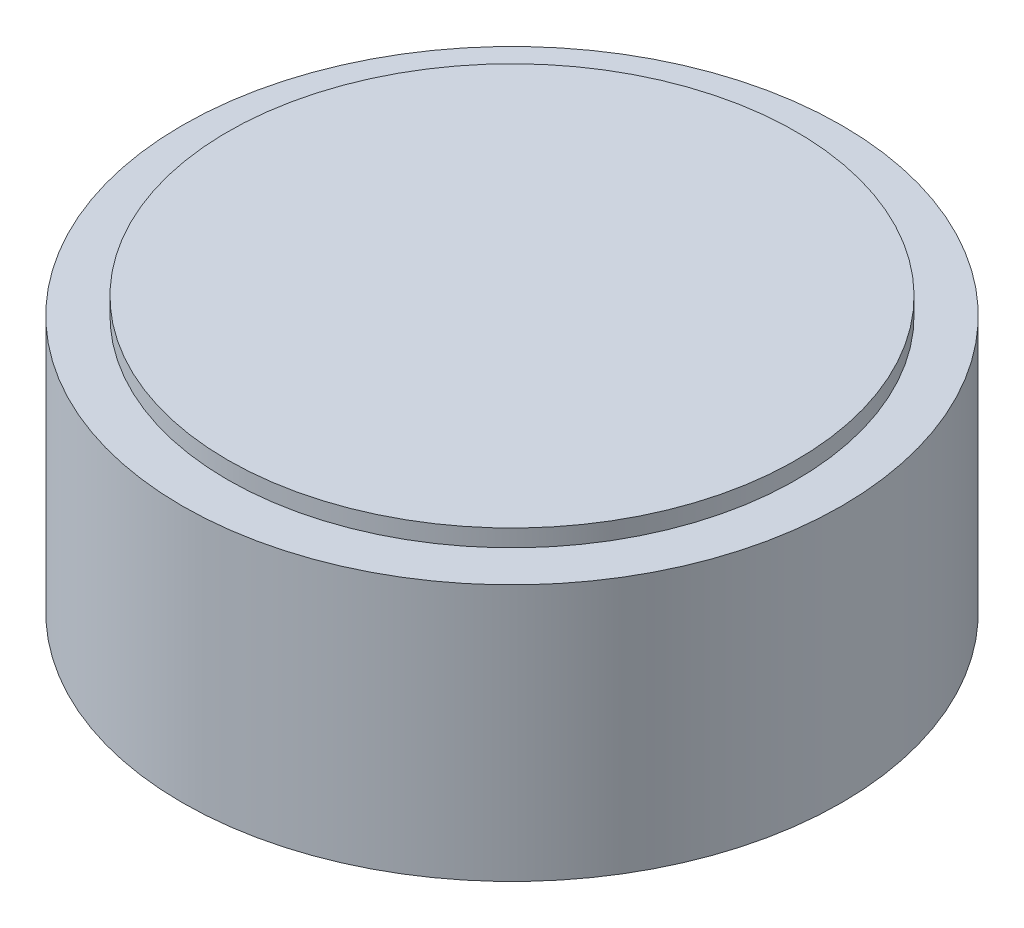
ISO-10303-21;
HEADER;
FILE_DESCRIPTION(('STEP AP214'),'2;1');
FILE_NAME('part.step','',(''),(''),'','','');
FILE_SCHEMA(('AUTOMOTIVE_DESIGN { 1 0 10303 214 1 1 1 1 }'));
ENDSEC;
DATA;
#1=APPLICATION_CONTEXT('core data for automotive mechanical design processes');
#2=APPLICATION_PROTOCOL_DEFINITION('international standard','automotive_design',2000,#1);
#3=PRODUCT_CONTEXT('',#1,'mechanical');
#4=PRODUCT('Part','Part','',(#3));
#5=PRODUCT_RELATED_PRODUCT_CATEGORY('part','',(#4));
#6=PRODUCT_DEFINITION_FORMATION('','',#4);
#7=PRODUCT_DEFINITION_CONTEXT('part definition',#1,'design');
#8=PRODUCT_DEFINITION('design','',#6,#7);
#9=PRODUCT_DEFINITION_SHAPE('','',#8);
#10=(LENGTH_UNIT() NAMED_UNIT(*) SI_UNIT(.MILLI.,.METRE.));
#11=(NAMED_UNIT(*) PLANE_ANGLE_UNIT() SI_UNIT($,.RADIAN.));
#12=(NAMED_UNIT(*) SI_UNIT($,.STERADIAN.) SOLID_ANGLE_UNIT());
#13=UNCERTAINTY_MEASURE_WITH_UNIT(LENGTH_MEASURE(1.E-05),#10,'distance_accuracy_value','');
#14=(GEOMETRIC_REPRESENTATION_CONTEXT(3) GLOBAL_UNCERTAINTY_ASSIGNED_CONTEXT((#13)) GLOBAL_UNIT_ASSIGNED_CONTEXT((#10,
#11,#12)) REPRESENTATION_CONTEXT('',''));
#15=CARTESIAN_POINT('',(0.,0.,0.));
#16=DIRECTION('',(0.,0.,1.));
#17=DIRECTION('',(1.,0.,0.));
#18=AXIS2_PLACEMENT_3D('',#15,#16,#17);
#19=CARTESIAN_POINT('',(0.,4.,0.));
#20=DIRECTION('',(0.,-1.,0.));
#21=DIRECTION('',(0.,0.,-1.));
#22=AXIS2_PLACEMENT_3D('',#19,#20,#21);
#23=CYLINDRICAL_SURFACE('',#22,9.625);
#24=CARTESIAN_POINT('',(0.,-4.,0.));
#25=DIRECTION('',(0.,1.,0.));
#26=DIRECTION('',(0.,0.,1.));
#27=AXIS2_PLACEMENT_3D('',#24,#25,#26);
#28=CIRCLE('',#27,9.625);
#29=CARTESIAN_POINT('',(0.,-4.,9.62499999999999));
#30=VERTEX_POINT('',#29);
#31=EDGE_CURVE('E10',#30,#30,#28,.T.);
#32=ORIENTED_EDGE('',*,*,#31,.T.);
#33=EDGE_LOOP('',(#32));
#34=FACE_BOUND('',#33,.T.);
#35=CARTESIAN_POINT('',(0.,3.5,0.));
#36=DIRECTION('',(0.,1.,0.));
#37=DIRECTION('',(0.,0.,1.));
#38=AXIS2_PLACEMENT_3D('',#35,#36,#37);
#39=CIRCLE('',#38,9.625);
#40=CARTESIAN_POINT('',(0.,3.5,9.62499999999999));
#41=VERTEX_POINT('',#40);
#42=EDGE_CURVE('E43',#41,#41,#39,.T.);
#43=ORIENTED_EDGE('',*,*,#42,.F.);
#44=EDGE_LOOP('',(#43));
#45=FACE_BOUND('',#44,.T.);
#46=ADVANCED_FACE('F36',(#34,#45),#23,.T.);
#47=CARTESIAN_POINT('',(0.,-4.,0.));
#48=DIRECTION('',(0.,1.,0.));
#49=DIRECTION('',(0.,0.,1.));
#50=AXIS2_PLACEMENT_3D('',#47,#48,#49);
#51=PLANE('',#50);
#52=CARTESIAN_POINT('',(0.,-4.,0.));
#53=DIRECTION('',(0.,-1.,0.));
#54=DIRECTION('',(0.,0.,-1.));
#55=AXIS2_PLACEMENT_3D('',#52,#53,#54);
#56=CIRCLE('',#55,1.5875);
#57=CARTESIAN_POINT('',(0.,-4.,-1.5875));
#58=VERTEX_POINT('',#57);
#59=EDGE_CURVE('E64',#58,#58,#56,.T.);
#60=ORIENTED_EDGE('',*,*,#59,.F.);
#61=EDGE_LOOP('',(#60));
#62=FACE_BOUND('',#61,.T.);
#63=ORIENTED_EDGE('',*,*,#31,.F.);
#64=EDGE_LOOP('',(#63));
#65=FACE_BOUND('',#64,.T.);
#66=ADVANCED_FACE('F70',(#62,#65),#51,.F.);
#67=CARTESIAN_POINT('',(0.,3.5,0.));
#68=DIRECTION('',(0.,1.,0.));
#69=DIRECTION('',(0.,0.,1.));
#70=AXIS2_PLACEMENT_3D('',#67,#68,#69);
#71=PLANE('',#70);
#72=CARTESIAN_POINT('',(0.,3.5,0.));
#73=DIRECTION('',(0.,1.,0.));
#74=DIRECTION('',(0.,0.,1.));
#75=AXIS2_PLACEMENT_3D('',#72,#73,#74);
#76=CIRCLE('',#75,8.3);
#77=CARTESIAN_POINT('',(0.,3.5,8.29999999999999));
#78=VERTEX_POINT('',#77);
#79=EDGE_CURVE('E49',#78,#78,#76,.T.);
#80=ORIENTED_EDGE('',*,*,#79,.F.);
#81=EDGE_LOOP('',(#80));
#82=FACE_BOUND('',#81,.T.);
#83=ORIENTED_EDGE('',*,*,#42,.T.);
#84=EDGE_LOOP('',(#83));
#85=FACE_BOUND('',#84,.T.);
#86=ADVANCED_FACE('F73',(#82,#85),#71,.T.);
#87=CARTESIAN_POINT('',(0.,3.5,0.));
#88=DIRECTION('',(0.,1.,0.));
#89=DIRECTION('',(0.,0.,1.));
#90=AXIS2_PLACEMENT_3D('',#87,#88,#89);
#91=CYLINDRICAL_SURFACE('',#90,8.3);
#92=ORIENTED_EDGE('',*,*,#79,.T.);
#93=EDGE_LOOP('',(#92));
#94=FACE_BOUND('',#93,.T.);
#95=CARTESIAN_POINT('',(0.,4.,0.));
#96=DIRECTION('',(0.,1.,0.));
#97=DIRECTION('',(0.,0.,1.));
#98=AXIS2_PLACEMENT_3D('',#95,#96,#97);
#99=CIRCLE('',#98,8.3);
#100=CARTESIAN_POINT('',(0.,4.,8.29999999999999));
#101=VERTEX_POINT('',#100);
#102=EDGE_CURVE('E56',#101,#101,#99,.T.);
#103=ORIENTED_EDGE('',*,*,#102,.F.);
#104=EDGE_LOOP('',(#103));
#105=FACE_BOUND('',#104,.T.);
#106=ADVANCED_FACE('F78',(#94,#105),#91,.T.);
#107=CARTESIAN_POINT('',(0.,4.,0.));
#108=DIRECTION('',(0.,1.,0.));
#109=DIRECTION('',(0.,0.,1.));
#110=AXIS2_PLACEMENT_3D('',#107,#108,#109);
#111=PLANE('',#110);
#112=ORIENTED_EDGE('',*,*,#102,.T.);
#113=EDGE_LOOP('',(#112));
#114=FACE_BOUND('',#113,.T.);
#115=ADVANCED_FACE('F82',(#114),#111,.T.);
#116=CARTESIAN_POINT('',(0.,0.999999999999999,0.));
#117=DIRECTION('',(0.,1.,0.));
#118=DIRECTION('',(0.,0.,1.));
#119=AXIS2_PLACEMENT_3D('',#116,#117,#118);
#120=PLANE('',#119);
#121=CARTESIAN_POINT('',(0.,0.999999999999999,0.));
#122=DIRECTION('',(0.,-1.,0.));
#123=DIRECTION('',(0.,0.,-1.));
#124=AXIS2_PLACEMENT_3D('',#121,#122,#123);
#125=CIRCLE('',#124,1.5875);
#126=CARTESIAN_POINT('',(0.,0.999999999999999,-1.5875));
#127=VERTEX_POINT('',#126);
#128=EDGE_CURVE('E60',#127,#127,#125,.T.);
#129=ORIENTED_EDGE('',*,*,#128,.T.);
#130=EDGE_LOOP('',(#129));
#131=FACE_BOUND('',#130,.T.);
#132=ADVANCED_FACE('F84',(#131),#120,.F.);
#133=CARTESIAN_POINT('',(0.,-4.,0.));
#134=DIRECTION('',(0.,-1.,0.));
#135=DIRECTION('',(0.,0.,-1.));
#136=AXIS2_PLACEMENT_3D('',#133,#134,#135);
#137=CYLINDRICAL_SURFACE('',#136,1.5875);
#138=ORIENTED_EDGE('',*,*,#128,.F.);
#139=EDGE_LOOP('',(#138));
#140=FACE_BOUND('',#139,.T.);
#141=ORIENTED_EDGE('',*,*,#59,.T.);
#142=EDGE_LOOP('',(#141));
#143=FACE_BOUND('',#142,.T.);
#144=ADVANCED_FACE('F68',(#140,#143),#137,.F.);
#145=CLOSED_SHELL('',(#46,#66,#86,#106,#115,#132,#144));
#146=MANIFOLD_SOLID_BREP('B2',#145);
#147=ADVANCED_BREP_SHAPE_REPRESENTATION('',(#18,#146),#14);
#148=SHAPE_DEFINITION_REPRESENTATION(#9,#147);
ENDSEC;
END-ISO-10303-21;
